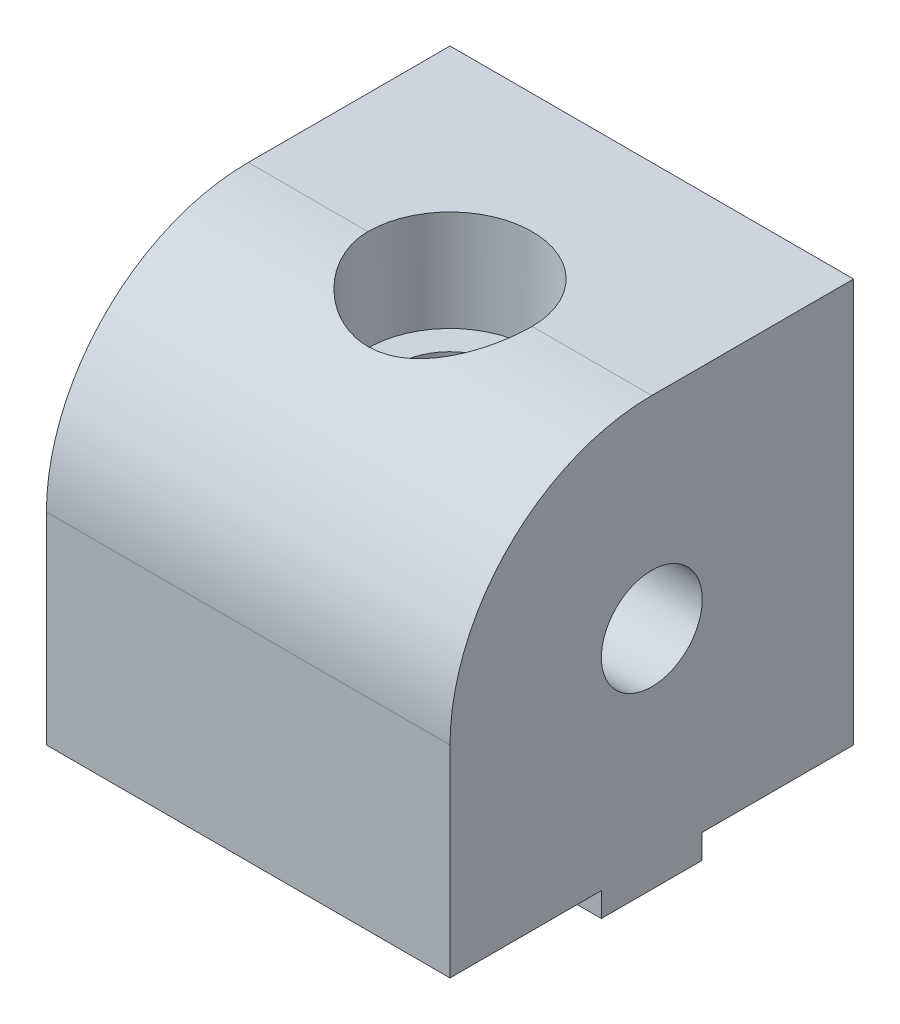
from build123d import *

# Parameters (mm, degrees)
SKETCH1_W           = 25.4
SKETCH1_H           = 25.4
BOSS_EXTRUDE1_DEPTH = 25.4
FILLET1_R           = 12.7
SKETCH2_R           = 3.3782
CUT_EXTRUDE1_DEPTH  = 32.108519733
SKETCH3_R           = 3.175
CUT_EXTRUDE2_DEPTH  = 39.100000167
SKETCH4_R           = 5.1689
CUT_EXTRUDE3_DEPTH  = 6.35
SKETCH5_W           = 6.35
SKETCH5_H           = 6.35
BOSS_EXTRUDE2_DEPTH = 1.524


with BuildPart() as part:
    # Sketch1 → Boss-Extrude1 (new body)
    with BuildSketch(Plane(origin=(0, 0, 0), x_dir=(1, 0, 0), z_dir=(0, 1, 0))):
        Rectangle(SKETCH1_W, SKETCH1_H)
    extrude(amount=BOSS_EXTRUDE1_DEPTH)

    # Fillet1
    fillet1_edges = [part.edges().sort_by_distance(p)[0] for p in [
        (0, 25.4, 12.7),
    ]]
    fillet(fillet1_edges, radius=FILLET1_R)

    # Sketch2 → Cut-Extrude1 (cut, through all)
    with BuildSketch(Plane(origin=(0, 25.4, 0), x_dir=(1, 0, 0), z_dir=(0, 1, 0))):
        with Locations(Location((0, 0, 0), (0, 0, 270))):
            Circle(SKETCH2_R)
    extrude(amount=-CUT_EXTRUDE1_DEPTH, mode=Mode.SUBTRACT)

    # Sketch3 → Cut-Extrude2 (cut, through all)
    with BuildSketch(Plane(origin=(12.7, 0, 0), x_dir=(0, 0, -1), z_dir=(1, 0, 0))):
        with Locations((0, 12.7)):
            Circle(SKETCH3_R)
    extrude(amount=-CUT_EXTRUDE2_DEPTH, mode=Mode.SUBTRACT)

    # Sketch4 → Cut-Extrude3 (cut)
    with BuildSketch(Plane(origin=(0, 25.4, 0), x_dir=(1, 0, 0), z_dir=(0, 1, 0))):
        with Locations(Location((0, 0, 0), (0, 0, 270))):
            Circle(SKETCH4_R)
    extrude(amount=-CUT_EXTRUDE3_DEPTH, mode=Mode.SUBTRACT)

    # Sketch5 → Boss-Extrude2 (add)
    with BuildSketch(Plane.XZ):
        with Locations((-9.525, 0)):
            Rectangle(SKETCH5_W, SKETCH5_H)
        with Locations((9.525, 0)):
            Rectangle(SKETCH5_W, SKETCH5_H)
    extrude(amount=BOSS_EXTRUDE2_DEPTH)


solid = part.part
